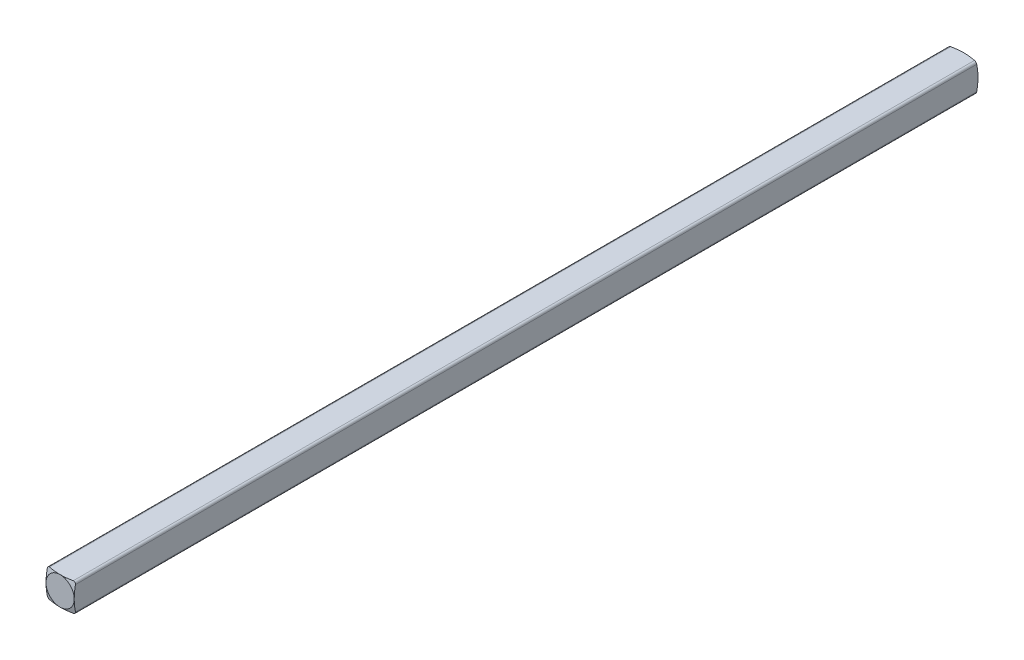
from build123d import *

# Parameters (mm, degrees)
SKETCH1_W      = 3.17
SKETCH1_H      = 3.17
EXTRUDE1_DEPTH = 50.8
FILLET1_R      = 0.25


with BuildPart() as part:
    # Sketch1 → Extrude1 (new, symmetric)
    with BuildSketch(Plane.XY):
        with Locations((0.050122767, 0)):
            Rectangle(SKETCH1_W, SKETCH1_H)
    extrude(amount=EXTRUDE1_DEPTH, both=True)

    # Sketch4 → Cut-Revolve3 (revolve, cut)
    with BuildSketch(Plane.XZ):
        Polygon((1.635122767, 50.8), (2.555122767, 50.8), (2.555122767, 50.53), align=None)
    cut_revolve3 = revolve(axis=Axis((0.050122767, 0, -50.8), (0, 0, 1)), mode=Mode.SUBTRACT)

    # Mirror2: Cut-Revolve3 across plane
    add(cut_revolve3.mirror(Plane.XY), mode=Mode.SUBTRACT)

    # Fillet1
    fillet1_edges = [part.edges().sort_by_distance(p)[0] for p in [
        (1.635122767, 1.585, 0),
        (1.635122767, -1.585, 0),
        (-1.534877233, -1.585, 0),
        (-1.534877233, 1.585, 0),
    ]]
    fillet(fillet1_edges, radius=FILLET1_R)


solid = part.part
